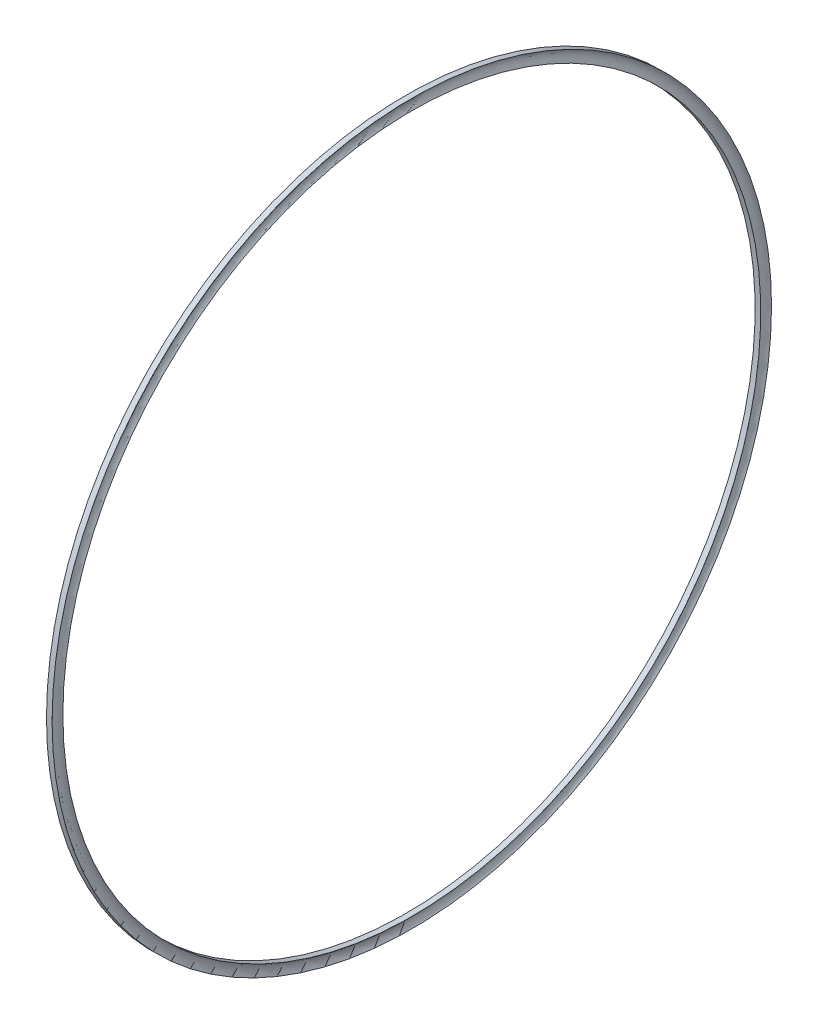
ISO-10303-21;
HEADER;
FILE_DESCRIPTION(('STEP AP214'),'2;1');
FILE_NAME('part.step','',(''),(''),'','','');
FILE_SCHEMA(('AUTOMOTIVE_DESIGN { 1 0 10303 214 1 1 1 1 }'));
ENDSEC;
DATA;
#1=APPLICATION_CONTEXT('core data for automotive mechanical design processes');
#2=APPLICATION_PROTOCOL_DEFINITION('international standard','automotive_design',2000,#1);
#3=PRODUCT_CONTEXT('',#1,'mechanical');
#4=PRODUCT('Part','Part','',(#3));
#5=PRODUCT_RELATED_PRODUCT_CATEGORY('part','',(#4));
#6=PRODUCT_DEFINITION_FORMATION('','',#4);
#7=PRODUCT_DEFINITION_CONTEXT('part definition',#1,'design');
#8=PRODUCT_DEFINITION('design','',#6,#7);
#9=PRODUCT_DEFINITION_SHAPE('','',#8);
#10=(LENGTH_UNIT() NAMED_UNIT(*) SI_UNIT(.MILLI.,.METRE.));
#11=(NAMED_UNIT(*) PLANE_ANGLE_UNIT() SI_UNIT($,.RADIAN.));
#12=(NAMED_UNIT(*) SI_UNIT($,.STERADIAN.) SOLID_ANGLE_UNIT());
#13=UNCERTAINTY_MEASURE_WITH_UNIT(LENGTH_MEASURE(1.E-05),#10,'distance_accuracy_value','');
#14=(GEOMETRIC_REPRESENTATION_CONTEXT(3) GLOBAL_UNCERTAINTY_ASSIGNED_CONTEXT((#13)) GLOBAL_UNIT_ASSIGNED_CONTEXT((#10,
#11,#12)) REPRESENTATION_CONTEXT('',''));
#15=CARTESIAN_POINT('',(0.,0.,0.));
#16=DIRECTION('',(0.,0.,1.));
#17=DIRECTION('',(1.,0.,0.));
#18=AXIS2_PLACEMENT_3D('',#15,#16,#17);
#19=CARTESIAN_POINT('',(0.,184.785000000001,0.));
#20=DIRECTION('',(1.,0.,0.));
#21=DIRECTION('',(0.,0.,-1.00000000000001));
#22=AXIS2_PLACEMENT_3D('',#19,#20,#21);
#23=PLANE('',#22);
#24=CARTESIAN_POINT('',(0.,0.,0.));
#25=DIRECTION('',(-1.,0.,0.));
#26=DIRECTION('',(0.,0.,1.00000000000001));
#27=AXIS2_PLACEMENT_3D('',#24,#25,#26);
#28=CIRCLE('',#27,184.785);
#29=CARTESIAN_POINT('',(0.,0.,184.785000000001));
#30=VERTEX_POINT('',#29);
#31=EDGE_CURVE('E10',#30,#30,#28,.T.);
#32=ORIENTED_EDGE('',*,*,#31,.F.);
#33=EDGE_LOOP('',(#32));
#34=FACE_BOUND('',#33,.T.);
#35=CARTESIAN_POINT('',(0.,0.,0.));
#36=DIRECTION('',(-1.,0.,0.));
#37=DIRECTION('',(0.,0.,1.00000000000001));
#38=AXIS2_PLACEMENT_3D('',#35,#36,#37);
#39=CIRCLE('',#38,190.5);
#40=CARTESIAN_POINT('',(0.,0.,190.500000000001));
#41=VERTEX_POINT('',#40);
#42=EDGE_CURVE('E395',#41,#41,#39,.T.);
#43=ORIENTED_EDGE('',*,*,#42,.T.);
#44=EDGE_LOOP('',(#43));
#45=FACE_BOUND('',#44,.T.);
#46=ADVANCED_FACE('F381',(#34,#45),#23,.F.);
#47=CARTESIAN_POINT('',(0.,0.,0.));
#48=DIRECTION('',(-1.,0.,0.));
#49=DIRECTION('',(0.,0.,1.00000000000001));
#50=AXIS2_PLACEMENT_3D('',#47,#48,#49);
#51=CYLINDRICAL_SURFACE('',#50,184.785);
#52=CARTESIAN_POINT('',(2.97180000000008,0.,0.));
#53=DIRECTION('',(-1.,0.,0.));
#54=DIRECTION('',(0.,0.,1.00000000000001));
#55=AXIS2_PLACEMENT_3D('',#52,#53,#54);
#56=CIRCLE('',#55,184.785);
#57=CARTESIAN_POINT('',(2.97180000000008,0.,184.785000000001));
#58=VERTEX_POINT('',#57);
#59=EDGE_CURVE('E387',#58,#58,#56,.T.);
#60=ORIENTED_EDGE('',*,*,#59,.F.);
#61=EDGE_LOOP('',(#60));
#62=FACE_BOUND('',#61,.T.);
#63=ORIENTED_EDGE('',*,*,#31,.T.);
#64=EDGE_LOOP('',(#63));
#65=FACE_BOUND('',#64,.T.);
#66=ADVANCED_FACE('F410',(#62,#65),#51,.F.);
#67=CARTESIAN_POINT('',(6.34338092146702,0.,0.));
#68=DIRECTION('',(-1.,0.,0.));
#69=DIRECTION('',(0.,0.,1.00000000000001));
#70=AXIS2_PLACEMENT_3D('',#67,#68,#69);
#71=TOROIDAL_SURFACE('',#70,187.6425,4.4196);
#72=CARTESIAN_POINT('',(2.97180000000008,0.,0.));
#73=DIRECTION('',(-1.,0.,0.));
#74=DIRECTION('',(0.,0.,1.00000000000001));
#75=AXIS2_PLACEMENT_3D('',#72,#73,#74);
#76=CIRCLE('',#75,190.5);
#77=CARTESIAN_POINT('',(2.97180000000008,0.,190.500000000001));
#78=VERTEX_POINT('',#77);
#79=EDGE_CURVE('E391',#78,#78,#76,.T.);
#80=ORIENTED_EDGE('',*,*,#79,.F.);
#81=EDGE_LOOP('',(#80));
#82=FACE_BOUND('',#81,.T.);
#83=ORIENTED_EDGE('',*,*,#59,.T.);
#84=EDGE_LOOP('',(#83));
#85=FACE_BOUND('',#84,.T.);
#86=ADVANCED_FACE('F405',(#82,#85),#71,.F.);
#87=CARTESIAN_POINT('',(0.,0.,0.));
#88=DIRECTION('',(-1.,0.,0.));
#89=DIRECTION('',(0.,0.,1.00000000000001));
#90=AXIS2_PLACEMENT_3D('',#87,#88,#89);
#91=CYLINDRICAL_SURFACE('',#90,190.5);
#92=ORIENTED_EDGE('',*,*,#42,.F.);
#93=EDGE_LOOP('',(#92));
#94=FACE_BOUND('',#93,.T.);
#95=ORIENTED_EDGE('',*,*,#79,.T.);
#96=EDGE_LOOP('',(#95));
#97=FACE_BOUND('',#96,.T.);
#98=ADVANCED_FACE('F402',(#94,#97),#91,.T.);
#99=CLOSED_SHELL('',(#46,#66,#86,#98));
#100=MANIFOLD_SOLID_BREP('B2',#99);
#101=ADVANCED_BREP_SHAPE_REPRESENTATION('',(#18,#100),#14);
#102=SHAPE_DEFINITION_REPRESENTATION(#9,#101);
ENDSEC;
END-ISO-10303-21;
